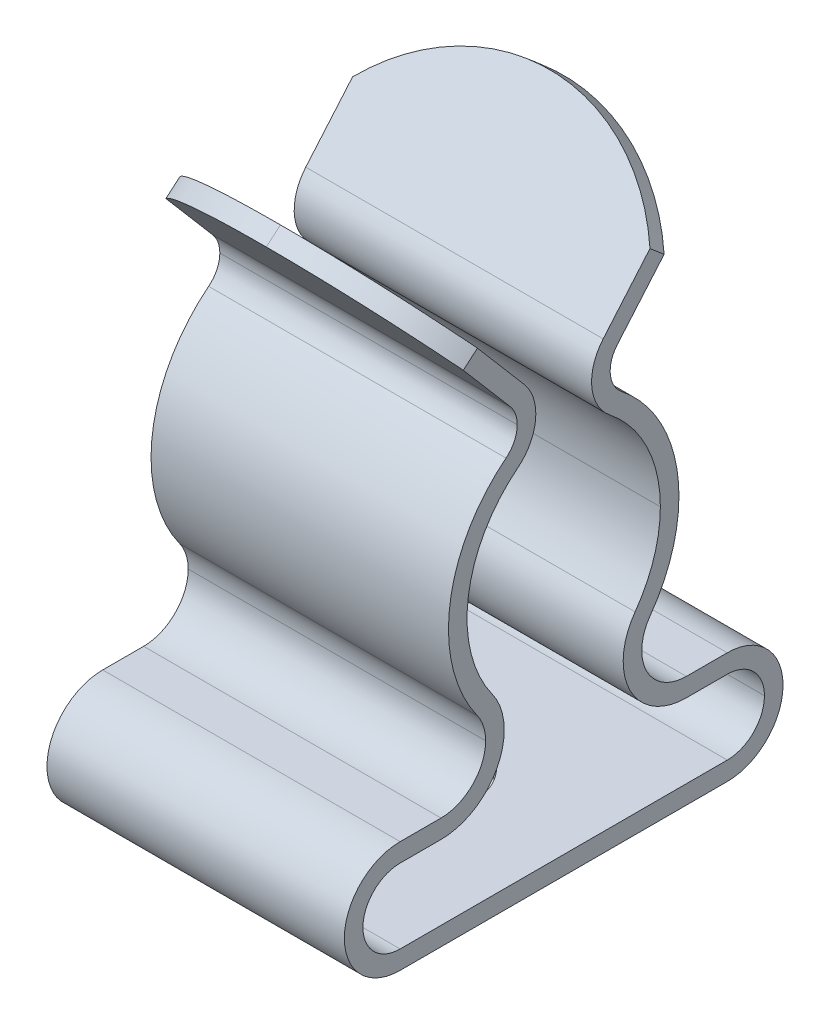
ISO-10303-21;
HEADER;
FILE_DESCRIPTION(('STEP AP214'),'2;1');
FILE_NAME('part.step','',(''),(''),'','','');
FILE_SCHEMA(('AUTOMOTIVE_DESIGN { 1 0 10303 214 1 1 1 1 }'));
ENDSEC;
DATA;
#1=APPLICATION_CONTEXT('core data for automotive mechanical design processes');
#2=APPLICATION_PROTOCOL_DEFINITION('international standard','automotive_design',2000,#1);
#3=PRODUCT_CONTEXT('',#1,'mechanical');
#4=PRODUCT('Part','Part','',(#3));
#5=PRODUCT_RELATED_PRODUCT_CATEGORY('part','',(#4));
#6=PRODUCT_DEFINITION_FORMATION('','',#4);
#7=PRODUCT_DEFINITION_CONTEXT('part definition',#1,'design');
#8=PRODUCT_DEFINITION('design','',#6,#7);
#9=PRODUCT_DEFINITION_SHAPE('','',#8);
#10=(LENGTH_UNIT() NAMED_UNIT(*) SI_UNIT(.MILLI.,.METRE.));
#11=(NAMED_UNIT(*) PLANE_ANGLE_UNIT() SI_UNIT($,.RADIAN.));
#12=(NAMED_UNIT(*) SI_UNIT($,.STERADIAN.) SOLID_ANGLE_UNIT());
#13=UNCERTAINTY_MEASURE_WITH_UNIT(LENGTH_MEASURE(1.E-05),#10,'distance_accuracy_value','');
#14=(GEOMETRIC_REPRESENTATION_CONTEXT(3) GLOBAL_UNCERTAINTY_ASSIGNED_CONTEXT((#13)) GLOBAL_UNIT_ASSIGNED_CONTEXT((#10,
#11,#12)) REPRESENTATION_CONTEXT('',''));
#15=CARTESIAN_POINT('',(0.,0.,0.));
#16=DIRECTION('',(0.,0.,1.));
#17=DIRECTION('',(1.,0.,0.));
#18=AXIS2_PLACEMENT_3D('',#15,#16,#17);
#19=CARTESIAN_POINT('',(20.,5.45,0.));
#20=DIRECTION('',(0.,-1.,0.));
#21=DIRECTION('',(1.,0.,0.));
#22=AXIS2_PLACEMENT_3D('',#19,#20,#21);
#23=CYLINDRICAL_SURFACE('',#22,1.55);
#24=DIRECTION('',(0.,-1.,0.));
#25=VECTOR('',#24,1.);
#26=CARTESIAN_POINT('',(18.45,5.45,0.));
#27=LINE('',#26,#25);
#28=CARTESIAN_POINT('',(18.45,5.95,0.));
#29=VERTEX_POINT('',#28);
#30=CARTESIAN_POINT('',(18.45,5.45,0.));
#31=VERTEX_POINT('',#30);
#32=EDGE_CURVE('E768',#29,#31,#27,.T.);
#33=ORIENTED_EDGE('',*,*,#32,.F.);
#34=CARTESIAN_POINT('',(20.,5.95,0.));
#35=DIRECTION('',(0.,1.,0.));
#36=DIRECTION('',(-1.,0.,0.));
#37=AXIS2_PLACEMENT_3D('',#34,#35,#36);
#38=CIRCLE('',#37,1.55);
#39=CARTESIAN_POINT('',(21.55,5.95,0.));
#40=VERTEX_POINT('',#39);
#41=EDGE_CURVE('E510',#29,#40,#38,.T.);
#42=ORIENTED_EDGE('',*,*,#41,.T.);
#43=DIRECTION('',(0.,-1.,0.));
#44=VECTOR('',#43,1.);
#45=CARTESIAN_POINT('',(21.55,5.45,0.));
#46=LINE('',#45,#44);
#47=CARTESIAN_POINT('',(21.55,5.45,0.));
#48=VERTEX_POINT('',#47);
#49=EDGE_CURVE('E757',#40,#48,#46,.T.);
#50=ORIENTED_EDGE('',*,*,#49,.T.);
#51=CARTESIAN_POINT('',(20.,5.45,0.));
#52=DIRECTION('',(0.,-1.,0.));
#53=DIRECTION('',(1.,0.,0.));
#54=AXIS2_PLACEMENT_3D('',#51,#52,#53);
#55=CIRCLE('',#54,1.55);
#56=EDGE_CURVE('E307',#48,#31,#55,.T.);
#57=ORIENTED_EDGE('',*,*,#56,.T.);
#58=EDGE_LOOP('',(#33,#42,#50,#57));
#59=FACE_BOUND('',#58,.T.);
#60=ADVANCED_FACE('F15',(#59),#23,.F.);
#61=CARTESIAN_POINT('',(20.,21.3264094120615,5.13195390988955));
#62=DIRECTION('',(0.,-0.649448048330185,-0.76040596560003));
#63=DIRECTION('',(0.,-0.76040596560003,0.649448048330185));
#64=AXIS2_PLACEMENT_3D('',#61,#62,#63);
#65=CYLINDRICAL_SURFACE('',#64,5.);
#66=CARTESIAN_POINT('',(20.,16.6251131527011,-0.372556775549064));
#67=DIRECTION('',(0.,-0.649448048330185,-0.76040596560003));
#68=DIRECTION('',(0.,0.76040596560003,-0.649448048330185));
#69=AXIS2_PLACEMENT_3D('',#66,#67,#68);
#70=CIRCLE('',#69,5.);
#71=CARTESIAN_POINT('',(16.,18.9063310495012,-2.32090092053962));
#72=VERTEX_POINT('',#71);
#73=CARTESIAN_POINT('',(24.,18.9063310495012,-2.32090092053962));
#74=VERTEX_POINT('',#73);
#75=EDGE_CURVE('E499',#72,#74,#70,.T.);
#76=ORIENTED_EDGE('',*,*,#75,.T.);
#77=DIRECTION('',(0.,-0.649448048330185,-0.76040596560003));
#78=VECTOR('',#77,1.);
#79=CARTESIAN_POINT('',(24.,23.6076273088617,3.18360976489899));
#80=LINE('',#79,#78);
#81=CARTESIAN_POINT('',(24.,18.5816070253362,-2.70110390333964));
#82=VERTEX_POINT('',#81);
#83=EDGE_CURVE('E528',#74,#82,#80,.T.);
#84=ORIENTED_EDGE('',*,*,#83,.T.);
#85=CARTESIAN_POINT('',(20.,16.3003891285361,-0.752759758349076));
#86=DIRECTION('',(0.,0.649448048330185,0.76040596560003));
#87=DIRECTION('',(0.,-0.76040596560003,0.649448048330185));
#88=AXIS2_PLACEMENT_3D('',#85,#86,#87);
#89=CIRCLE('',#88,5.);
#90=CARTESIAN_POINT('',(16.,18.5816070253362,-2.70110390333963));
#91=VERTEX_POINT('',#90);
#92=EDGE_CURVE('E519',#82,#91,#89,.T.);
#93=ORIENTED_EDGE('',*,*,#92,.T.);
#94=DIRECTION('',(0.,-0.649448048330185,-0.76040596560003));
#95=VECTOR('',#94,1.);
#96=CARTESIAN_POINT('',(16.,23.6076273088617,3.18360976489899));
#97=LINE('',#96,#95);
#98=EDGE_CURVE('E450',#72,#91,#97,.T.);
#99=ORIENTED_EDGE('',*,*,#98,.F.);
#100=EDGE_LOOP('',(#76,#84,#93,#99));
#101=FACE_BOUND('',#100,.T.);
#102=ADVANCED_FACE('F836',(#101),#65,.T.);
#103=CARTESIAN_POINT('',(20.,21.3264094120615,-5.13195390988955));
#104=DIRECTION('',(0.,-0.649448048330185,0.76040596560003));
#105=DIRECTION('',(0.,0.76040596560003,0.649448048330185));
#106=AXIS2_PLACEMENT_3D('',#103,#104,#105);
#107=CYLINDRICAL_SURFACE('',#106,5.);
#108=DIRECTION('',(0.,-0.649448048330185,0.76040596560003));
#109=VECTOR('',#108,1.);
#110=CARTESIAN_POINT('',(20.,25.1284392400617,-1.88471366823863));
#111=LINE('',#110,#109);
#112=CARTESIAN_POINT('',(20.,20.4271429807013,3.61979701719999));
#113=VERTEX_POINT('',#112);
#114=CARTESIAN_POINT('',(20.,20.1024189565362,4.));
#115=VERTEX_POINT('',#114);
#116=EDGE_CURVE('E745',#113,#115,#111,.T.);
#117=ORIENTED_EDGE('',*,*,#116,.F.);
#118=CARTESIAN_POINT('',(20.,16.6251131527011,0.372556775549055));
#119=DIRECTION('',(0.,-0.649448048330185,0.76040596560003));
#120=DIRECTION('',(0.,-0.76040596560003,-0.649448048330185));
#121=AXIS2_PLACEMENT_3D('',#118,#119,#120);
#122=CIRCLE('',#121,5.);
#123=CARTESIAN_POINT('',(16.,18.9063310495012,2.32090092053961));
#124=VERTEX_POINT('',#123);
#125=EDGE_CURVE('E604',#113,#124,#122,.T.);
#126=ORIENTED_EDGE('',*,*,#125,.T.);
#127=DIRECTION('',(0.,-0.649448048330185,0.76040596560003));
#128=VECTOR('',#127,1.);
#129=CARTESIAN_POINT('',(16.,23.6076273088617,-3.18360976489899));
#130=LINE('',#129,#128);
#131=CARTESIAN_POINT('',(16.,18.5816070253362,2.70110390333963));
#132=VERTEX_POINT('',#131);
#133=EDGE_CURVE('E569',#124,#132,#130,.T.);
#134=ORIENTED_EDGE('',*,*,#133,.T.);
#135=CARTESIAN_POINT('',(20.,16.3003891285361,0.752759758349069));
#136=DIRECTION('',(0.,0.649448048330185,-0.76040596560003));
#137=DIRECTION('',(0.,-0.76040596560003,-0.649448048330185));
#138=AXIS2_PLACEMENT_3D('',#135,#136,#137);
#139=CIRCLE('',#138,5.);
#140=EDGE_CURVE('E592',#132,#115,#139,.T.);
#141=ORIENTED_EDGE('',*,*,#140,.T.);
#142=EDGE_LOOP('',(#117,#126,#134,#141));
#143=FACE_BOUND('',#142,.T.);
#144=ADVANCED_FACE('F841',(#143),#107,.T.);
#145=CARTESIAN_POINT('',(16.,16.5874470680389,2.05));
#146=DIRECTION('',(1.,0.,0.));
#147=DIRECTION('',(0.,0.,-1.));
#148=AXIS2_PLACEMENT_3D('',#145,#146,#147);
#149=CYLINDRICAL_SURFACE('',#148,0.8);
#150=DIRECTION('',(1.,0.,0.));
#151=VECTOR('',#150,1.);
#152=CARTESIAN_POINT('',(16.,16.5874470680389,1.25));
#153=LINE('',#152,#151);
#154=CARTESIAN_POINT('',(16.,16.5874470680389,1.25));
#155=VERTEX_POINT('',#154);
#156=CARTESIAN_POINT('',(24.,16.5874470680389,1.25));
#157=VERTEX_POINT('',#156);
#158=EDGE_CURVE('E743',#155,#157,#153,.T.);
#159=ORIENTED_EDGE('',*,*,#158,.F.);
#160=CARTESIAN_POINT('',(16.,16.5874470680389,2.05));
#161=DIRECTION('',(1.,0.,0.));
#162=DIRECTION('',(0.,0.,-1.));
#163=AXIS2_PLACEMENT_3D('',#160,#161,#162);
#164=CIRCLE('',#163,0.8);
#165=CARTESIAN_POINT('',(16.,15.9615637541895,1.55173292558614));
#166=VERTEX_POINT('',#165);
#167=EDGE_CURVE('E564',#166,#155,#164,.T.);
#168=ORIENTED_EDGE('',*,*,#167,.F.);
#169=DIRECTION('',(1.,0.,0.));
#170=VECTOR('',#169,1.);
#171=CARTESIAN_POINT('',(16.,15.9615637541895,1.55173292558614));
#172=LINE('',#171,#170);
#173=CARTESIAN_POINT('',(24.,15.9615637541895,1.55173292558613));
#174=VERTEX_POINT('',#173);
#175=EDGE_CURVE('E10',#166,#174,#172,.T.);
#176=ORIENTED_EDGE('',*,*,#175,.T.);
#177=CARTESIAN_POINT('',(24.,16.5874470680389,2.05));
#178=DIRECTION('',(1.,0.,0.));
#179=DIRECTION('',(0.,0.,-1.));
#180=AXIS2_PLACEMENT_3D('',#177,#178,#179);
#181=CIRCLE('',#180,0.8);
#182=EDGE_CURVE('E347',#174,#157,#181,.T.);
#183=ORIENTED_EDGE('',*,*,#182,.T.);
#184=EDGE_LOOP('',(#159,#168,#176,#183));
#185=FACE_BOUND('',#184,.T.);
#186=ADVANCED_FACE('F919',(#185),#149,.F.);
#187=CARTESIAN_POINT('',(16.,12.75,-1.005));
#188=DIRECTION('',(1.,0.,0.));
#189=DIRECTION('',(0.,0.,-1.));
#190=AXIS2_PLACEMENT_3D('',#187,#188,#189);
#191=CYLINDRICAL_SURFACE('',#190,4.105);
#192=CARTESIAN_POINT('',(24.,12.75,-1.005));
#193=DIRECTION('',(-1.,0.,0.));
#194=DIRECTION('',(0.,0.,1.));
#195=AXIS2_PLACEMENT_3D('',#192,#193,#194);
#196=CIRCLE('',#195,4.105);
#197=CARTESIAN_POINT('',(24.,10.3512252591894,2.32620169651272));
#198=VERTEX_POINT('',#197);
#199=EDGE_CURVE('E342',#198,#174,#196,.T.);
#200=ORIENTED_EDGE('',*,*,#199,.T.);
#201=ORIENTED_EDGE('',*,*,#175,.F.);
#202=CARTESIAN_POINT('',(16.,12.75,-1.005));
#203=DIRECTION('',(-1.,0.,0.));
#204=DIRECTION('',(0.,0.,1.));
#205=AXIS2_PLACEMENT_3D('',#202,#203,#204);
#206=CIRCLE('',#205,4.105);
#207=CARTESIAN_POINT('',(16.,10.3512252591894,2.32620169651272));
#208=VERTEX_POINT('',#207);
#209=EDGE_CURVE('E560',#208,#166,#206,.T.);
#210=ORIENTED_EDGE('',*,*,#209,.F.);
#211=DIRECTION('',(1.,0.,0.));
#212=VECTOR('',#211,1.);
#213=CARTESIAN_POINT('',(16.,10.3512252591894,2.32620169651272));
#214=LINE('',#213,#212);
#215=EDGE_CURVE('E660',#208,#198,#214,.T.);
#216=ORIENTED_EDGE('',*,*,#215,.T.);
#217=EDGE_LOOP('',(#200,#201,#210,#216));
#218=FACE_BOUND('',#217,.T.);
#219=ADVANCED_FACE('F913',(#218),#191,.T.);
#220=CARTESIAN_POINT('',(16.,9.65,3.3));
#221=DIRECTION('',(1.,0.,0.));
#222=DIRECTION('',(0.,0.,-1.));
#223=AXIS2_PLACEMENT_3D('',#220,#221,#222);
#224=CYLINDRICAL_SURFACE('',#223,1.2);
#225=DIRECTION('',(1.,0.,0.));
#226=VECTOR('',#225,1.);
#227=CARTESIAN_POINT('',(16.,9.65,2.1));
#228=LINE('',#227,#226);
#229=CARTESIAN_POINT('',(16.,9.65,2.1));
#230=VERTEX_POINT('',#229);
#231=CARTESIAN_POINT('',(24.,9.65,2.1));
#232=VERTEX_POINT('',#231);
#233=EDGE_CURVE('E658',#230,#232,#228,.T.);
#234=ORIENTED_EDGE('',*,*,#233,.F.);
#235=CARTESIAN_POINT('',(16.,9.65,3.3));
#236=DIRECTION('',(1.,0.,0.));
#237=DIRECTION('',(0.,0.,-1.));
#238=AXIS2_PLACEMENT_3D('',#235,#236,#237);
#239=CIRCLE('',#238,1.2);
#240=CARTESIAN_POINT('',(16.,8.45,3.3));
#241=VERTEX_POINT('',#240);
#242=EDGE_CURVE('E326',#241,#230,#239,.T.);
#243=ORIENTED_EDGE('',*,*,#242,.F.);
#244=DIRECTION('',(1.,0.,0.));
#245=VECTOR('',#244,1.);
#246=CARTESIAN_POINT('',(16.,8.45,3.3));
#247=LINE('',#246,#245);
#248=CARTESIAN_POINT('',(24.,8.45,3.3));
#249=VERTEX_POINT('',#248);
#250=EDGE_CURVE('E24',#241,#249,#247,.T.);
#251=ORIENTED_EDGE('',*,*,#250,.T.);
#252=CARTESIAN_POINT('',(24.,9.65,3.3));
#253=DIRECTION('',(1.,0.,0.));
#254=DIRECTION('',(0.,0.,-1.));
#255=AXIS2_PLACEMENT_3D('',#252,#253,#254);
#256=CIRCLE('',#255,1.2);
#257=EDGE_CURVE('E323',#249,#232,#256,.T.);
#258=ORIENTED_EDGE('',*,*,#257,.T.);
#259=EDGE_LOOP('',(#234,#243,#251,#258));
#260=FACE_BOUND('',#259,.T.);
#261=ADVANCED_FACE('F320',(#260),#224,.F.);
#262=CARTESIAN_POINT('',(16.,8.45,4.4));
#263=DIRECTION('',(0.,-1.,0.));
#264=DIRECTION('',(0.,0.,-1.));
#265=AXIS2_PLACEMENT_3D('',#262,#263,#264);
#266=PLANE('',#265);
#267=DIRECTION('',(0.,0.,-1.));
#268=VECTOR('',#267,1.);
#269=CARTESIAN_POINT('',(24.,8.45,4.4));
#270=LINE('',#269,#268);
#271=CARTESIAN_POINT('',(24.,8.45,4.4));
#272=VERTEX_POINT('',#271);
#273=EDGE_CURVE('E331',#272,#249,#270,.T.);
#274=ORIENTED_EDGE('',*,*,#273,.T.);
#275=ORIENTED_EDGE('',*,*,#250,.F.);
#276=DIRECTION('',(0.,0.,-1.));
#277=VECTOR('',#276,1.);
#278=CARTESIAN_POINT('',(16.,8.45,4.4));
#279=LINE('',#278,#277);
#280=CARTESIAN_POINT('',(16.,8.45,4.4));
#281=VERTEX_POINT('',#280);
#282=EDGE_CURVE('E555',#281,#241,#279,.T.);
#283=ORIENTED_EDGE('',*,*,#282,.F.);
#284=DIRECTION('',(1.,0.,0.));
#285=VECTOR('',#284,1.);
#286=CARTESIAN_POINT('',(16.,8.45,4.4));
#287=LINE('',#286,#285);
#288=EDGE_CURVE('E311',#281,#272,#287,.T.);
#289=ORIENTED_EDGE('',*,*,#288,.T.);
#290=EDGE_LOOP('',(#274,#275,#283,#289));
#291=FACE_BOUND('',#290,.T.);
#292=ADVANCED_FACE('F332',(#291),#266,.F.);
#293=CARTESIAN_POINT('',(16.,6.95,4.4));
#294=DIRECTION('',(1.,0.,0.));
#295=DIRECTION('',(0.,0.,-1.));
#296=AXIS2_PLACEMENT_3D('',#293,#294,#295);
#297=CYLINDRICAL_SURFACE('',#296,1.5);
#298=CARTESIAN_POINT('',(24.,6.95,4.4));
#299=DIRECTION('',(-1.,0.,0.));
#300=DIRECTION('',(0.,0.,1.));
#301=AXIS2_PLACEMENT_3D('',#298,#299,#300);
#302=CIRCLE('',#301,1.5);
#303=CARTESIAN_POINT('',(24.,5.45,4.4));
#304=VERTEX_POINT('',#303);
#305=EDGE_CURVE('E284',#304,#272,#302,.T.);
#306=ORIENTED_EDGE('',*,*,#305,.T.);
#307=ORIENTED_EDGE('',*,*,#288,.F.);
#308=CARTESIAN_POINT('',(16.,6.95,4.4));
#309=DIRECTION('',(-1.,0.,0.));
#310=DIRECTION('',(0.,0.,1.));
#311=AXIS2_PLACEMENT_3D('',#308,#309,#310);
#312=CIRCLE('',#311,1.5);
#313=CARTESIAN_POINT('',(16.,5.45,4.4));
#314=VERTEX_POINT('',#313);
#315=EDGE_CURVE('E551',#314,#281,#312,.T.);
#316=ORIENTED_EDGE('',*,*,#315,.F.);
#317=DIRECTION('',(1.,0.,0.));
#318=VECTOR('',#317,1.);
#319=CARTESIAN_POINT('',(16.,5.45,4.4));
#320=LINE('',#319,#318);
#321=EDGE_CURVE('E260',#314,#304,#320,.T.);
#322=ORIENTED_EDGE('',*,*,#321,.T.);
#323=EDGE_LOOP('',(#306,#307,#316,#322));
#324=FACE_BOUND('',#323,.T.);
#325=ADVANCED_FACE('F354',(#324),#297,.T.);
#326=CARTESIAN_POINT('',(16.,5.45,4.4));
#327=DIRECTION('',(0.,1.,0.));
#328=DIRECTION('',(0.,0.,1.));
#329=AXIS2_PLACEMENT_3D('',#326,#327,#328);
#330=PLANE('',#329);
#331=ORIENTED_EDGE('',*,*,#56,.F.);
#332=CARTESIAN_POINT('',(20.,5.45,0.));
#333=DIRECTION('',(0.,-1.,0.));
#334=DIRECTION('',(1.,0.,0.));
#335=AXIS2_PLACEMENT_3D('',#332,#333,#334);
#336=CIRCLE('',#335,1.55);
#337=EDGE_CURVE('E761',#31,#48,#336,.T.);
#338=ORIENTED_EDGE('',*,*,#337,.F.);
#339=EDGE_LOOP('',(#331,#338));
#340=FACE_BOUND('',#339,.T.);
#341=DIRECTION('',(0.,0.,1.));
#342=VECTOR('',#341,1.);
#343=CARTESIAN_POINT('',(24.,5.45,4.4));
#344=LINE('',#343,#342);
#345=CARTESIAN_POINT('',(24.,5.45,-4.4));
#346=VERTEX_POINT('',#345);
#347=EDGE_CURVE('E277',#346,#304,#344,.T.);
#348=ORIENTED_EDGE('',*,*,#347,.T.);
#349=ORIENTED_EDGE('',*,*,#321,.F.);
#350=DIRECTION('',(0.,0.,1.));
#351=VECTOR('',#350,1.);
#352=CARTESIAN_POINT('',(16.,5.45,4.4));
#353=LINE('',#352,#351);
#354=CARTESIAN_POINT('',(16.,5.45,-4.4));
#355=VERTEX_POINT('',#354);
#356=EDGE_CURVE('E363',#355,#314,#353,.T.);
#357=ORIENTED_EDGE('',*,*,#356,.F.);
#358=DIRECTION('',(1.,0.,0.));
#359=VECTOR('',#358,1.);
#360=CARTESIAN_POINT('',(16.,5.45,-4.4));
#361=LINE('',#360,#359);
#362=EDGE_CURVE('E360',#355,#346,#361,.T.);
#363=ORIENTED_EDGE('',*,*,#362,.T.);
#364=EDGE_LOOP('',(#348,#349,#357,#363));
#365=FACE_BOUND('',#364,.T.);
#366=ADVANCED_FACE('F361',(#340,#365),#330,.F.);
#367=CARTESIAN_POINT('',(16.,6.95,-4.4));
#368=DIRECTION('',(1.,0.,0.));
#369=DIRECTION('',(0.,0.,-1.));
#370=AXIS2_PLACEMENT_3D('',#367,#368,#369);
#371=CYLINDRICAL_SURFACE('',#370,1.5);
#372=DIRECTION('',(1.,0.,0.));
#373=VECTOR('',#372,1.);
#374=CARTESIAN_POINT('',(16.,6.95,-5.9));
#375=LINE('',#374,#373);
#376=CARTESIAN_POINT('',(16.,6.95,-5.9));
#377=VERTEX_POINT('',#376);
#378=CARTESIAN_POINT('',(24.,6.95,-5.9));
#379=VERTEX_POINT('',#378);
#380=EDGE_CURVE('E371',#377,#379,#375,.T.);
#381=ORIENTED_EDGE('',*,*,#380,.F.);
#382=CARTESIAN_POINT('',(16.,6.95,-4.4));
#383=DIRECTION('',(-1.,0.,0.));
#384=DIRECTION('',(0.,0.,-1.));
#385=AXIS2_PLACEMENT_3D('',#382,#383,#384);
#386=CIRCLE('',#385,1.5);
#387=CARTESIAN_POINT('',(16.,8.45,-4.4));
#388=VERTEX_POINT('',#387);
#389=EDGE_CURVE('E255',#388,#377,#386,.T.);
#390=ORIENTED_EDGE('',*,*,#389,.F.);
#391=DIRECTION('',(1.,0.,0.));
#392=VECTOR('',#391,1.);
#393=CARTESIAN_POINT('',(16.,8.45,-4.4));
#394=LINE('',#393,#392);
#395=CARTESIAN_POINT('',(24.,8.45,-4.4));
#396=VERTEX_POINT('',#395);
#397=EDGE_CURVE('E247',#388,#396,#394,.T.);
#398=ORIENTED_EDGE('',*,*,#397,.T.);
#399=CARTESIAN_POINT('',(24.,6.95,-4.4));
#400=DIRECTION('',(-1.,0.,0.));
#401=DIRECTION('',(0.,0.,-1.));
#402=AXIS2_PLACEMENT_3D('',#399,#400,#401);
#403=CIRCLE('',#402,1.5);
#404=EDGE_CURVE('E252',#396,#379,#403,.T.);
#405=ORIENTED_EDGE('',*,*,#404,.T.);
#406=EDGE_LOOP('',(#381,#390,#398,#405));
#407=FACE_BOUND('',#406,.T.);
#408=ADVANCED_FACE('F250',(#407),#371,.T.);
#409=CARTESIAN_POINT('',(16.,8.45,-4.4));
#410=DIRECTION('',(0.,-1.,0.));
#411=DIRECTION('',(1.,0.,0.));
#412=AXIS2_PLACEMENT_3D('',#409,#410,#411);
#413=PLANE('',#412);
#414=DIRECTION('',(0.,0.,-1.));
#415=VECTOR('',#414,1.);
#416=CARTESIAN_POINT('',(24.,8.45,-4.4));
#417=LINE('',#416,#415);
#418=CARTESIAN_POINT('',(24.,8.45,-3.3));
#419=VERTEX_POINT('',#418);
#420=EDGE_CURVE('E264',#419,#396,#417,.T.);
#421=ORIENTED_EDGE('',*,*,#420,.T.);
#422=ORIENTED_EDGE('',*,*,#397,.F.);
#423=DIRECTION('',(0.,0.,-1.));
#424=VECTOR('',#423,1.);
#425=CARTESIAN_POINT('',(16.,8.45,-4.4));
#426=LINE('',#425,#424);
#427=CARTESIAN_POINT('',(16.,8.45,-3.3));
#428=VERTEX_POINT('',#427);
#429=EDGE_CURVE('E544',#428,#388,#426,.T.);
#430=ORIENTED_EDGE('',*,*,#429,.F.);
#431=DIRECTION('',(1.,0.,0.));
#432=VECTOR('',#431,1.);
#433=CARTESIAN_POINT('',(16.,8.45,-3.3));
#434=LINE('',#433,#432);
#435=EDGE_CURVE('E261',#428,#419,#434,.T.);
#436=ORIENTED_EDGE('',*,*,#435,.T.);
#437=EDGE_LOOP('',(#421,#422,#430,#436));
#438=FACE_BOUND('',#437,.T.);
#439=ADVANCED_FACE('F265',(#438),#413,.F.);
#440=CARTESIAN_POINT('',(16.,9.65,-3.3));
#441=DIRECTION('',(1.,0.,0.));
#442=DIRECTION('',(0.,0.,-1.));
#443=AXIS2_PLACEMENT_3D('',#440,#441,#442);
#444=CYLINDRICAL_SURFACE('',#443,1.2);
#445=CARTESIAN_POINT('',(24.,9.65,-3.3));
#446=DIRECTION('',(1.,0.,0.));
#447=DIRECTION('',(0.,0.,1.));
#448=AXIS2_PLACEMENT_3D('',#445,#446,#447);
#449=CIRCLE('',#448,1.2);
#450=CARTESIAN_POINT('',(24.,10.3512252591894,-2.32620169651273));
#451=VERTEX_POINT('',#450);
#452=EDGE_CURVE('E269',#451,#419,#449,.T.);
#453=ORIENTED_EDGE('',*,*,#452,.T.);
#454=ORIENTED_EDGE('',*,*,#435,.F.);
#455=CARTESIAN_POINT('',(16.,9.65,-3.3));
#456=DIRECTION('',(1.,0.,0.));
#457=DIRECTION('',(0.,0.,1.));
#458=AXIS2_PLACEMENT_3D('',#455,#456,#457);
#459=CIRCLE('',#458,1.2);
#460=CARTESIAN_POINT('',(16.,10.3512252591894,-2.32620169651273));
#461=VERTEX_POINT('',#460);
#462=EDGE_CURVE('E382',#461,#428,#459,.T.);
#463=ORIENTED_EDGE('',*,*,#462,.F.);
#464=DIRECTION('',(1.,0.,0.));
#465=VECTOR('',#464,1.);
#466=CARTESIAN_POINT('',(16.,10.3512252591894,-2.32620169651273));
#467=LINE('',#466,#465);
#468=EDGE_CURVE('E406',#461,#451,#467,.T.);
#469=ORIENTED_EDGE('',*,*,#468,.T.);
#470=EDGE_LOOP('',(#453,#454,#463,#469));
#471=FACE_BOUND('',#470,.T.);
#472=ADVANCED_FACE('F951',(#471),#444,.F.);
#473=CARTESIAN_POINT('',(16.,12.75,1.005));
#474=DIRECTION('',(1.,0.,0.));
#475=DIRECTION('',(0.,0.,-1.));
#476=AXIS2_PLACEMENT_3D('',#473,#474,#475);
#477=CYLINDRICAL_SURFACE('',#476,4.105);
#478=DIRECTION('',(1.,0.,0.));
#479=VECTOR('',#478,1.);
#480=CARTESIAN_POINT('',(16.,12.75,-3.1));
#481=LINE('',#480,#479);
#482=CARTESIAN_POINT('',(16.,12.75,-3.1));
#483=VERTEX_POINT('',#482);
#484=CARTESIAN_POINT('',(24.,12.75,-3.1));
#485=VERTEX_POINT('',#484);
#486=EDGE_CURVE('E387',#483,#485,#481,.T.);
#487=ORIENTED_EDGE('',*,*,#486,.F.);
#488=CARTESIAN_POINT('',(16.,12.75,1.005));
#489=DIRECTION('',(-1.,0.,0.));
#490=DIRECTION('',(0.,0.,-1.));
#491=AXIS2_PLACEMENT_3D('',#488,#489,#490);
#492=CIRCLE('',#491,4.105);
#493=CARTESIAN_POINT('',(16.,15.9615637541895,-1.55173292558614));
#494=VERTEX_POINT('',#493);
#495=EDGE_CURVE('E379',#494,#483,#492,.T.);
#496=ORIENTED_EDGE('',*,*,#495,.F.);
#497=DIRECTION('',(1.,0.,0.));
#498=VECTOR('',#497,1.);
#499=CARTESIAN_POINT('',(16.,15.9615637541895,-1.55173292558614));
#500=LINE('',#499,#498);
#501=CARTESIAN_POINT('',(24.,15.9615637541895,-1.55173292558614));
#502=VERTEX_POINT('',#501);
#503=EDGE_CURVE('E36',#494,#502,#500,.T.);
#504=ORIENTED_EDGE('',*,*,#503,.T.);
#505=CARTESIAN_POINT('',(24.,12.75,1.005));
#506=DIRECTION('',(-1.,0.,0.));
#507=DIRECTION('',(0.,0.,-1.));
#508=AXIS2_PLACEMENT_3D('',#505,#506,#507);
#509=CIRCLE('',#508,4.105);
#510=EDGE_CURVE('E289',#502,#485,#509,.T.);
#511=ORIENTED_EDGE('',*,*,#510,.T.);
#512=EDGE_LOOP('',(#487,#496,#504,#511));
#513=FACE_BOUND('',#512,.T.);
#514=ADVANCED_FACE('F954',(#513),#477,.T.);
#515=CARTESIAN_POINT('',(16.,16.5874470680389,-2.05));
#516=DIRECTION('',(1.,0.,0.));
#517=DIRECTION('',(0.,0.,-1.));
#518=AXIS2_PLACEMENT_3D('',#515,#516,#517);
#519=CYLINDRICAL_SURFACE('',#518,0.8);
#520=CARTESIAN_POINT('',(24.,16.5874470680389,-2.05));
#521=DIRECTION('',(1.,0.,0.));
#522=DIRECTION('',(0.,0.,1.));
#523=AXIS2_PLACEMENT_3D('',#520,#521,#522);
#524=CIRCLE('',#523,0.8);
#525=CARTESIAN_POINT('',(24.,17.107005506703,-1.44167522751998));
#526=VERTEX_POINT('',#525);
#527=EDGE_CURVE('E292',#526,#502,#524,.T.);
#528=ORIENTED_EDGE('',*,*,#527,.T.);
#529=ORIENTED_EDGE('',*,*,#503,.F.);
#530=CARTESIAN_POINT('',(16.,16.5874470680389,-2.05));
#531=DIRECTION('',(1.,0.,0.));
#532=DIRECTION('',(0.,0.,1.));
#533=AXIS2_PLACEMENT_3D('',#530,#531,#532);
#534=CIRCLE('',#533,0.8);
#535=CARTESIAN_POINT('',(16.,17.107005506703,-1.44167522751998));
#536=VERTEX_POINT('',#535);
#537=EDGE_CURVE('E383',#536,#494,#534,.T.);
#538=ORIENTED_EDGE('',*,*,#537,.F.);
#539=DIRECTION('',(1.,0.,0.));
#540=VECTOR('',#539,1.);
#541=CARTESIAN_POINT('',(16.,17.107005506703,-1.44167522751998));
#542=LINE('',#541,#540);
#543=EDGE_CURVE('E532',#536,#526,#542,.T.);
#544=ORIENTED_EDGE('',*,*,#543,.T.);
#545=EDGE_LOOP('',(#528,#529,#538,#544));
#546=FACE_BOUND('',#545,.T.);
#547=ADVANCED_FACE('F958',(#546),#519,.F.);
#548=CARTESIAN_POINT('',(16.,16.5874470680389,-2.05));
#549=DIRECTION('',(1.,0.,0.));
#550=DIRECTION('',(0.,0.,-1.));
#551=AXIS2_PLACEMENT_3D('',#548,#549,#550);
#552=CYLINDRICAL_SURFACE('',#551,1.3);
#553=CARTESIAN_POINT('',(24.,16.5874470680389,-2.05));
#554=DIRECTION('',(1.,0.,0.));
#555=DIRECTION('',(0.,0.,1.));
#556=AXIS2_PLACEMENT_3D('',#553,#554,#555);
#557=CIRCLE('',#556,1.3);
#558=CARTESIAN_POINT('',(24.,17.4317295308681,-1.06147224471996));
#559=VERTEX_POINT('',#558);
#560=CARTESIAN_POINT('',(24.,15.5703866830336,-1.24031600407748));
#561=VERTEX_POINT('',#560);
#562=EDGE_CURVE('E524',#559,#561,#557,.T.);
#563=ORIENTED_EDGE('',*,*,#562,.F.);
#564=DIRECTION('',(1.,0.,0.));
#565=VECTOR('',#564,1.);
#566=CARTESIAN_POINT('',(16.,17.4317295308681,-1.06147224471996));
#567=LINE('',#566,#565);
#568=CARTESIAN_POINT('',(16.,17.4317295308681,-1.06147224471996));
#569=VERTEX_POINT('',#568);
#570=EDGE_CURVE('E507',#569,#559,#567,.T.);
#571=ORIENTED_EDGE('',*,*,#570,.F.);
#572=CARTESIAN_POINT('',(16.,16.5874470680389,-2.05));
#573=DIRECTION('',(1.,0.,0.));
#574=DIRECTION('',(0.,0.,1.));
#575=AXIS2_PLACEMENT_3D('',#572,#573,#574);
#576=CIRCLE('',#575,1.3);
#577=CARTESIAN_POINT('',(16.,15.5703866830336,-1.24031600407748));
#578=VERTEX_POINT('',#577);
#579=EDGE_CURVE('E428',#569,#578,#576,.T.);
#580=ORIENTED_EDGE('',*,*,#579,.T.);
#581=DIRECTION('',(1.,0.,0.));
#582=VECTOR('',#581,1.);
#583=CARTESIAN_POINT('',(16.,15.5703866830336,-1.24031600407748));
#584=LINE('',#583,#582);
#585=EDGE_CURVE('E440',#578,#561,#584,.T.);
#586=ORIENTED_EDGE('',*,*,#585,.T.);
#587=EDGE_LOOP('',(#563,#571,#580,#586));
#588=FACE_BOUND('',#587,.T.);
#589=ADVANCED_FACE('F790',(#588),#552,.T.);
#590=CARTESIAN_POINT('',(16.,12.75,1.005));
#591=DIRECTION('',(1.,0.,0.));
#592=DIRECTION('',(0.,0.,-1.));
#593=AXIS2_PLACEMENT_3D('',#590,#591,#592);
#594=CYLINDRICAL_SURFACE('',#593,3.605);
#595=DIRECTION('',(1.,0.,0.));
#596=VECTOR('',#595,1.);
#597=CARTESIAN_POINT('',(16.,12.75,-2.6));
#598=LINE('',#597,#596);
#599=CARTESIAN_POINT('',(16.,12.75,-2.6));
#600=VERTEX_POINT('',#599);
#601=CARTESIAN_POINT('',(24.,12.75,-2.6));
#602=VERTEX_POINT('',#601);
#603=EDGE_CURVE('E423',#600,#602,#598,.T.);
#604=ORIENTED_EDGE('',*,*,#603,.F.);
#605=CARTESIAN_POINT('',(16.,12.75,1.005));
#606=DIRECTION('',(-1.,0.,0.));
#607=DIRECTION('',(0.,0.,1.));
#608=AXIS2_PLACEMENT_3D('',#605,#606,#607);
#609=CIRCLE('',#608,3.605);
#610=CARTESIAN_POINT('',(16.,10.6434024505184,-1.92045240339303));
#611=VERTEX_POINT('',#610);
#612=EDGE_CURVE('E424',#600,#611,#609,.T.);
#613=ORIENTED_EDGE('',*,*,#612,.T.);
#614=DIRECTION('',(1.,0.,0.));
#615=VECTOR('',#614,1.);
#616=CARTESIAN_POINT('',(16.,10.6434024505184,-1.92045240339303));
#617=LINE('',#616,#615);
#618=CARTESIAN_POINT('',(24.,10.6434024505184,-1.92045240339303));
#619=VERTEX_POINT('',#618);
#620=EDGE_CURVE('E306',#611,#619,#617,.T.);
#621=ORIENTED_EDGE('',*,*,#620,.T.);
#622=CARTESIAN_POINT('',(24.,12.75,1.005));
#623=DIRECTION('',(-1.,0.,0.));
#624=DIRECTION('',(0.,0.,1.));
#625=AXIS2_PLACEMENT_3D('',#622,#623,#624);
#626=CIRCLE('',#625,3.605);
#627=EDGE_CURVE('E527',#602,#619,#626,.T.);
#628=ORIENTED_EDGE('',*,*,#627,.F.);
#629=EDGE_LOOP('',(#604,#613,#621,#628));
#630=FACE_BOUND('',#629,.T.);
#631=ADVANCED_FACE('F799',(#630),#594,.F.);
#632=CARTESIAN_POINT('',(16.,9.65,-3.3));
#633=DIRECTION('',(1.,0.,0.));
#634=DIRECTION('',(0.,0.,-1.));
#635=AXIS2_PLACEMENT_3D('',#632,#633,#634);
#636=CYLINDRICAL_SURFACE('',#635,1.7);
#637=CARTESIAN_POINT('',(24.,9.65,-3.3));
#638=DIRECTION('',(1.,0.,0.));
#639=DIRECTION('',(0.,0.,1.));
#640=AXIS2_PLACEMENT_3D('',#637,#638,#639);
#641=CIRCLE('',#640,1.7);
#642=CARTESIAN_POINT('',(24.,7.95,-3.3));
#643=VERTEX_POINT('',#642);
#644=EDGE_CURVE('E392',#619,#643,#641,.T.);
#645=ORIENTED_EDGE('',*,*,#644,.F.);
#646=ORIENTED_EDGE('',*,*,#620,.F.);
#647=CARTESIAN_POINT('',(16.,9.65,-3.3));
#648=DIRECTION('',(1.,0.,0.));
#649=DIRECTION('',(0.,0.,1.));
#650=AXIS2_PLACEMENT_3D('',#647,#648,#649);
#651=CIRCLE('',#650,1.7);
#652=CARTESIAN_POINT('',(16.,7.95,-3.3));
#653=VERTEX_POINT('',#652);
#654=EDGE_CURVE('E429',#611,#653,#651,.T.);
#655=ORIENTED_EDGE('',*,*,#654,.T.);
#656=DIRECTION('',(1.,0.,0.));
#657=VECTOR('',#656,1.);
#658=CARTESIAN_POINT('',(16.,7.95,-3.3));
#659=LINE('',#658,#657);
#660=EDGE_CURVE('E436',#653,#643,#659,.T.);
#661=ORIENTED_EDGE('',*,*,#660,.T.);
#662=EDGE_LOOP('',(#645,#646,#655,#661));
#663=FACE_BOUND('',#662,.T.);
#664=ADVANCED_FACE('F803',(#663),#636,.T.);
#665=CARTESIAN_POINT('',(16.,7.95,-4.4));
#666=DIRECTION('',(0.,-1.,0.));
#667=DIRECTION('',(1.,0.,0.));
#668=AXIS2_PLACEMENT_3D('',#665,#666,#667);
#669=PLANE('',#668);
#670=DIRECTION('',(0.,0.,-1.));
#671=VECTOR('',#670,1.);
#672=CARTESIAN_POINT('',(24.,7.95,-4.4));
#673=LINE('',#672,#671);
#674=CARTESIAN_POINT('',(24.,7.95,-4.4));
#675=VERTEX_POINT('',#674);
#676=EDGE_CURVE('E388',#643,#675,#673,.T.);
#677=ORIENTED_EDGE('',*,*,#676,.F.);
#678=ORIENTED_EDGE('',*,*,#660,.F.);
#679=DIRECTION('',(0.,0.,-1.));
#680=VECTOR('',#679,1.);
#681=CARTESIAN_POINT('',(16.,7.95,-4.4));
#682=LINE('',#681,#680);
#683=CARTESIAN_POINT('',(16.,7.95,-4.4));
#684=VERTEX_POINT('',#683);
#685=EDGE_CURVE('E418',#653,#684,#682,.T.);
#686=ORIENTED_EDGE('',*,*,#685,.T.);
#687=DIRECTION('',(1.,0.,0.));
#688=VECTOR('',#687,1.);
#689=CARTESIAN_POINT('',(16.,7.95,-4.4));
#690=LINE('',#689,#688);
#691=EDGE_CURVE('E462',#684,#675,#690,.T.);
#692=ORIENTED_EDGE('',*,*,#691,.T.);
#693=EDGE_LOOP('',(#677,#678,#686,#692));
#694=FACE_BOUND('',#693,.T.);
#695=ADVANCED_FACE('F808',(#694),#669,.T.);
#696=CARTESIAN_POINT('',(16.,6.95,-4.4));
#697=DIRECTION('',(1.,0.,0.));
#698=DIRECTION('',(0.,0.,-1.));
#699=AXIS2_PLACEMENT_3D('',#696,#697,#698);
#700=CYLINDRICAL_SURFACE('',#699,1.);
#701=DIRECTION('',(1.,0.,0.));
#702=VECTOR('',#701,1.);
#703=CARTESIAN_POINT('',(16.,6.95,-5.4));
#704=LINE('',#703,#702);
#705=CARTESIAN_POINT('',(16.,6.95,-5.4));
#706=VERTEX_POINT('',#705);
#707=CARTESIAN_POINT('',(24.,6.95,-5.4));
#708=VERTEX_POINT('',#707);
#709=EDGE_CURVE('E454',#706,#708,#704,.T.);
#710=ORIENTED_EDGE('',*,*,#709,.F.);
#711=CARTESIAN_POINT('',(16.,6.95,-4.4));
#712=DIRECTION('',(-1.,0.,0.));
#713=DIRECTION('',(0.,0.,1.));
#714=AXIS2_PLACEMENT_3D('',#711,#712,#713);
#715=CIRCLE('',#714,1.);
#716=CARTESIAN_POINT('',(16.,5.95,-4.4));
#717=VERTEX_POINT('',#716);
#718=EDGE_CURVE('E414',#706,#717,#715,.T.);
#719=ORIENTED_EDGE('',*,*,#718,.T.);
#720=DIRECTION('',(1.,0.,0.));
#721=VECTOR('',#720,1.);
#722=CARTESIAN_POINT('',(16.,5.95,-4.4));
#723=LINE('',#722,#721);
#724=CARTESIAN_POINT('',(24.,5.95,-4.4));
#725=VERTEX_POINT('',#724);
#726=EDGE_CURVE('E303',#717,#725,#723,.T.);
#727=ORIENTED_EDGE('',*,*,#726,.T.);
#728=CARTESIAN_POINT('',(24.,6.95,-4.4));
#729=DIRECTION('',(-1.,0.,0.));
#730=DIRECTION('',(0.,0.,1.));
#731=AXIS2_PLACEMENT_3D('',#728,#729,#730);
#732=CIRCLE('',#731,1.);
#733=EDGE_CURVE('E391',#708,#725,#732,.T.);
#734=ORIENTED_EDGE('',*,*,#733,.F.);
#735=EDGE_LOOP('',(#710,#719,#727,#734));
#736=FACE_BOUND('',#735,.T.);
#737=ADVANCED_FACE('F816',(#736),#700,.F.);
#738=CARTESIAN_POINT('',(16.,5.95,4.4));
#739=DIRECTION('',(0.,1.,0.));
#740=DIRECTION('',(0.,0.,1.));
#741=AXIS2_PLACEMENT_3D('',#738,#739,#740);
#742=PLANE('',#741);
#743=CARTESIAN_POINT('',(20.,5.95,0.));
#744=DIRECTION('',(0.,1.,0.));
#745=DIRECTION('',(-1.,0.,0.));
#746=AXIS2_PLACEMENT_3D('',#743,#744,#745);
#747=CIRCLE('',#746,1.55);
#748=EDGE_CURVE('E775',#40,#29,#747,.T.);
#749=ORIENTED_EDGE('',*,*,#748,.F.);
#750=ORIENTED_EDGE('',*,*,#41,.F.);
#751=EDGE_LOOP('',(#749,#750));
#752=FACE_BOUND('',#751,.T.);
#753=DIRECTION('',(0.,0.,1.));
#754=VECTOR('',#753,1.);
#755=CARTESIAN_POINT('',(24.,5.95,4.4));
#756=LINE('',#755,#754);
#757=CARTESIAN_POINT('',(24.,5.95,4.4));
#758=VERTEX_POINT('',#757);
#759=EDGE_CURVE('E616',#725,#758,#756,.T.);
#760=ORIENTED_EDGE('',*,*,#759,.F.);
#761=ORIENTED_EDGE('',*,*,#726,.F.);
#762=DIRECTION('',(0.,0.,1.));
#763=VECTOR('',#762,1.);
#764=CARTESIAN_POINT('',(16.,5.95,4.4));
#765=LINE('',#764,#763);
#766=CARTESIAN_POINT('',(16.,5.95,4.4));
#767=VERTEX_POINT('',#766);
#768=EDGE_CURVE('E419',#717,#767,#765,.T.);
#769=ORIENTED_EDGE('',*,*,#768,.T.);
#770=DIRECTION('',(1.,0.,0.));
#771=VECTOR('',#770,1.);
#772=CARTESIAN_POINT('',(16.,5.95,4.4));
#773=LINE('',#772,#771);
#774=EDGE_CURVE('E300',#767,#758,#773,.T.);
#775=ORIENTED_EDGE('',*,*,#774,.T.);
#776=EDGE_LOOP('',(#760,#761,#769,#775));
#777=FACE_BOUND('',#776,.T.);
#778=ADVANCED_FACE('F820',(#752,#777),#742,.T.);
#779=CARTESIAN_POINT('',(16.,6.95,4.4));
#780=DIRECTION('',(1.,0.,0.));
#781=DIRECTION('',(0.,0.,-1.));
#782=AXIS2_PLACEMENT_3D('',#779,#780,#781);
#783=CYLINDRICAL_SURFACE('',#782,1.);
#784=CARTESIAN_POINT('',(24.,6.95,4.4));
#785=DIRECTION('',(-1.,0.,0.));
#786=DIRECTION('',(0.,0.,1.));
#787=AXIS2_PLACEMENT_3D('',#784,#785,#786);
#788=CIRCLE('',#787,1.);
#789=CARTESIAN_POINT('',(24.,7.95,4.4));
#790=VERTEX_POINT('',#789);
#791=EDGE_CURVE('E620',#758,#790,#788,.T.);
#792=ORIENTED_EDGE('',*,*,#791,.F.);
#793=ORIENTED_EDGE('',*,*,#774,.F.);
#794=CARTESIAN_POINT('',(16.,6.95,4.4));
#795=DIRECTION('',(-1.,0.,0.));
#796=DIRECTION('',(0.,0.,1.));
#797=AXIS2_PLACEMENT_3D('',#794,#795,#796);
#798=CIRCLE('',#797,1.);
#799=CARTESIAN_POINT('',(16.,7.95,4.4));
#800=VERTEX_POINT('',#799);
#801=EDGE_CURVE('E475',#767,#800,#798,.T.);
#802=ORIENTED_EDGE('',*,*,#801,.T.);
#803=DIRECTION('',(1.,0.,0.));
#804=VECTOR('',#803,1.);
#805=CARTESIAN_POINT('',(16.,7.95,4.4));
#806=LINE('',#805,#804);
#807=EDGE_CURVE('E299',#800,#790,#806,.T.);
#808=ORIENTED_EDGE('',*,*,#807,.T.);
#809=EDGE_LOOP('',(#792,#793,#802,#808));
#810=FACE_BOUND('',#809,.T.);
#811=ADVANCED_FACE('F823',(#810),#783,.F.);
#812=CARTESIAN_POINT('',(16.,7.95,4.4));
#813=DIRECTION('',(0.,-1.,0.));
#814=DIRECTION('',(0.,0.,-1.));
#815=AXIS2_PLACEMENT_3D('',#812,#813,#814);
#816=PLANE('',#815);
#817=DIRECTION('',(0.,0.,-1.));
#818=VECTOR('',#817,1.);
#819=CARTESIAN_POINT('',(24.,7.95,4.4));
#820=LINE('',#819,#818);
#821=CARTESIAN_POINT('',(24.,7.95,3.3));
#822=VERTEX_POINT('',#821);
#823=EDGE_CURVE('E624',#790,#822,#820,.T.);
#824=ORIENTED_EDGE('',*,*,#823,.F.);
#825=ORIENTED_EDGE('',*,*,#807,.F.);
#826=DIRECTION('',(0.,0.,-1.));
#827=VECTOR('',#826,1.);
#828=CARTESIAN_POINT('',(16.,7.95,4.4));
#829=LINE('',#828,#827);
#830=CARTESIAN_POINT('',(16.,7.95,3.3));
#831=VERTEX_POINT('',#830);
#832=EDGE_CURVE('E401',#800,#831,#829,.T.);
#833=ORIENTED_EDGE('',*,*,#832,.T.);
#834=DIRECTION('',(1.,0.,0.));
#835=VECTOR('',#834,1.);
#836=CARTESIAN_POINT('',(16.,7.95,3.3));
#837=LINE('',#836,#835);
#838=EDGE_CURVE('E479',#831,#822,#837,.T.);
#839=ORIENTED_EDGE('',*,*,#838,.T.);
#840=EDGE_LOOP('',(#824,#825,#833,#839));
#841=FACE_BOUND('',#840,.T.);
#842=ADVANCED_FACE('F825',(#841),#816,.T.);
#843=CARTESIAN_POINT('',(16.,9.65,3.3));
#844=DIRECTION('',(1.,0.,0.));
#845=DIRECTION('',(0.,0.,-1.));
#846=AXIS2_PLACEMENT_3D('',#843,#844,#845);
#847=CYLINDRICAL_SURFACE('',#846,1.7);
#848=DIRECTION('',(1.,0.,0.));
#849=VECTOR('',#848,1.);
#850=CARTESIAN_POINT('',(16.,9.65,1.6));
#851=LINE('',#850,#849);
#852=CARTESIAN_POINT('',(16.,9.65,1.6));
#853=VERTEX_POINT('',#852);
#854=CARTESIAN_POINT('',(24.,9.65,1.6));
#855=VERTEX_POINT('',#854);
#856=EDGE_CURVE('E470',#853,#855,#851,.T.);
#857=ORIENTED_EDGE('',*,*,#856,.F.);
#858=CARTESIAN_POINT('',(16.,9.65,3.3));
#859=DIRECTION('',(1.,0.,0.));
#860=DIRECTION('',(0.,0.,1.));
#861=AXIS2_PLACEMENT_3D('',#858,#859,#860);
#862=CIRCLE('',#861,1.7);
#863=CARTESIAN_POINT('',(16.,10.6434024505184,1.92045240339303));
#864=VERTEX_POINT('',#863);
#865=EDGE_CURVE('E397',#853,#864,#862,.T.);
#866=ORIENTED_EDGE('',*,*,#865,.T.);
#867=DIRECTION('',(1.,0.,0.));
#868=VECTOR('',#867,1.);
#869=CARTESIAN_POINT('',(16.,10.6434024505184,1.92045240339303));
#870=LINE('',#869,#868);
#871=CARTESIAN_POINT('',(24.,10.6434024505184,1.92045240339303));
#872=VERTEX_POINT('',#871);
#873=EDGE_CURVE('E295',#864,#872,#870,.T.);
#874=ORIENTED_EDGE('',*,*,#873,.T.);
#875=CARTESIAN_POINT('',(24.,9.65,3.3));
#876=DIRECTION('',(1.,0.,0.));
#877=DIRECTION('',(0.,0.,1.));
#878=AXIS2_PLACEMENT_3D('',#875,#876,#877);
#879=CIRCLE('',#878,1.7);
#880=EDGE_CURVE('E627',#855,#872,#879,.T.);
#881=ORIENTED_EDGE('',*,*,#880,.F.);
#882=EDGE_LOOP('',(#857,#866,#874,#881));
#883=FACE_BOUND('',#882,.T.);
#884=ADVANCED_FACE('F688',(#883),#847,.T.);
#885=CARTESIAN_POINT('',(16.,12.75,-1.005));
#886=DIRECTION('',(1.,0.,0.));
#887=DIRECTION('',(0.,0.,-1.));
#888=AXIS2_PLACEMENT_3D('',#885,#886,#887);
#889=CYLINDRICAL_SURFACE('',#888,3.605);
#890=CARTESIAN_POINT('',(24.,12.75,-1.005));
#891=DIRECTION('',(-1.,0.,0.));
#892=DIRECTION('',(0.,0.,1.));
#893=AXIS2_PLACEMENT_3D('',#890,#891,#892);
#894=CIRCLE('',#893,3.605);
#895=CARTESIAN_POINT('',(24.,15.5703866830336,1.24031600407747));
#896=VERTEX_POINT('',#895);
#897=EDGE_CURVE('E632',#872,#896,#894,.T.);
#898=ORIENTED_EDGE('',*,*,#897,.F.);
#899=ORIENTED_EDGE('',*,*,#873,.F.);
#900=CARTESIAN_POINT('',(16.,12.75,-1.005));
#901=DIRECTION('',(-1.,0.,0.));
#902=DIRECTION('',(0.,0.,1.));
#903=AXIS2_PLACEMENT_3D('',#900,#901,#902);
#904=CIRCLE('',#903,3.605);
#905=CARTESIAN_POINT('',(16.,15.5703866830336,1.24031600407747));
#906=VERTEX_POINT('',#905);
#907=EDGE_CURVE('E402',#864,#906,#904,.T.);
#908=ORIENTED_EDGE('',*,*,#907,.T.);
#909=DIRECTION('',(1.,0.,0.));
#910=VECTOR('',#909,1.);
#911=CARTESIAN_POINT('',(16.,15.5703866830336,1.24031600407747));
#912=LINE('',#911,#910);
#913=EDGE_CURVE('E495',#906,#896,#912,.T.);
#914=ORIENTED_EDGE('',*,*,#913,.T.);
#915=EDGE_LOOP('',(#898,#899,#908,#914));
#916=FACE_BOUND('',#915,.T.);
#917=ADVANCED_FACE('F691',(#916),#889,.F.);
#918=CARTESIAN_POINT('',(16.,16.5874470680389,2.05));
#919=DIRECTION('',(1.,0.,0.));
#920=DIRECTION('',(0.,0.,-1.));
#921=AXIS2_PLACEMENT_3D('',#918,#919,#920);
#922=CYLINDRICAL_SURFACE('',#921,1.3);
#923=DIRECTION('',(1.,0.,0.));
#924=VECTOR('',#923,1.);
#925=CARTESIAN_POINT('',(16.,16.5874470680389,0.75));
#926=LINE('',#925,#924);
#927=CARTESIAN_POINT('',(16.,16.5874470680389,0.75));
#928=VERTEX_POINT('',#927);
#929=CARTESIAN_POINT('',(24.,16.5874470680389,0.75));
#930=VERTEX_POINT('',#929);
#931=EDGE_CURVE('E487',#928,#930,#926,.T.);
#932=ORIENTED_EDGE('',*,*,#931,.F.);
#933=CARTESIAN_POINT('',(16.,16.5874470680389,2.05));
#934=DIRECTION('',(1.,0.,0.));
#935=DIRECTION('',(0.,0.,1.));
#936=AXIS2_PLACEMENT_3D('',#933,#934,#935);
#937=CIRCLE('',#936,1.3);
#938=CARTESIAN_POINT('',(16.,17.4317295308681,1.06147224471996));
#939=VERTEX_POINT('',#938);
#940=EDGE_CURVE('E409',#928,#939,#937,.T.);
#941=ORIENTED_EDGE('',*,*,#940,.T.);
#942=DIRECTION('',(1.,0.,0.));
#943=VECTOR('',#942,1.);
#944=CARTESIAN_POINT('',(16.,17.4317295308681,1.06147224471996));
#945=LINE('',#944,#943);
#946=CARTESIAN_POINT('',(24.,17.4317295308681,1.06147224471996));
#947=VERTEX_POINT('',#946);
#948=EDGE_CURVE('E600',#939,#947,#945,.T.);
#949=ORIENTED_EDGE('',*,*,#948,.T.);
#950=CARTESIAN_POINT('',(24.,16.5874470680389,2.05));
#951=DIRECTION('',(1.,0.,0.));
#952=DIRECTION('',(0.,0.,1.));
#953=AXIS2_PLACEMENT_3D('',#950,#951,#952);
#954=CIRCLE('',#953,1.3);
#955=EDGE_CURVE('E633',#930,#947,#954,.T.);
#956=ORIENTED_EDGE('',*,*,#955,.F.);
#957=EDGE_LOOP('',(#932,#941,#949,#956));
#958=FACE_BOUND('',#957,.T.);
#959=ADVANCED_FACE('F711',(#958),#922,.T.);
#960=CARTESIAN_POINT('',(24.,16.5874470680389,2.05));
#961=DIRECTION('',(-1.,0.,0.));
#962=DIRECTION('',(0.,0.,1.));
#963=AXIS2_PLACEMENT_3D('',#960,#961,#962);
#964=PLANE('',#963);
#965=DIRECTION('',(0.,-0.76040596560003,0.649448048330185));
#966=VECTOR('',#965,1.);
#967=CARTESIAN_POINT('',(24.,17.107005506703,-1.44167522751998));
#968=LINE('',#967,#966);
#969=EDGE_CURVE('E523',#82,#526,#968,.T.);
#970=ORIENTED_EDGE('',*,*,#969,.F.);
#971=ORIENTED_EDGE('',*,*,#83,.F.);
#972=DIRECTION('',(0.,-0.76040596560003,0.649448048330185));
#973=VECTOR('',#972,1.);
#974=CARTESIAN_POINT('',(24.,17.4317295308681,-1.06147224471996));
#975=LINE('',#974,#973);
#976=EDGE_CURVE('E514',#74,#559,#975,.T.);
#977=ORIENTED_EDGE('',*,*,#976,.T.);
#978=ORIENTED_EDGE('',*,*,#562,.T.);
#979=CARTESIAN_POINT('',(24.,12.75,1.005));
#980=DIRECTION('',(-1.,0.,0.));
#981=DIRECTION('',(0.,0.,1.));
#982=AXIS2_PLACEMENT_3D('',#979,#980,#981);
#983=CIRCLE('',#982,3.605);
#984=EDGE_CURVE('E433',#561,#602,#983,.T.);
#985=ORIENTED_EDGE('',*,*,#984,.T.);
#986=ORIENTED_EDGE('',*,*,#627,.T.);
#987=ORIENTED_EDGE('',*,*,#644,.T.);
#988=ORIENTED_EDGE('',*,*,#676,.T.);
#989=CARTESIAN_POINT('',(24.,6.95,-4.4));
#990=DIRECTION('',(-1.,0.,0.));
#991=DIRECTION('',(0.,0.,1.));
#992=AXIS2_PLACEMENT_3D('',#989,#990,#991);
#993=CIRCLE('',#992,1.);
#994=EDGE_CURVE('E458',#675,#708,#993,.T.);
#995=ORIENTED_EDGE('',*,*,#994,.T.);
#996=ORIENTED_EDGE('',*,*,#733,.T.);
#997=ORIENTED_EDGE('',*,*,#759,.T.);
#998=ORIENTED_EDGE('',*,*,#791,.T.);
#999=ORIENTED_EDGE('',*,*,#823,.T.);
#1000=CARTESIAN_POINT('',(24.,9.65,3.3));
#1001=DIRECTION('',(1.,0.,0.));
#1002=DIRECTION('',(0.,0.,1.));
#1003=AXIS2_PLACEMENT_3D('',#1000,#1001,#1002);
#1004=CIRCLE('',#1003,1.7);
#1005=EDGE_CURVE('E474',#822,#855,#1004,.T.);
#1006=ORIENTED_EDGE('',*,*,#1005,.T.);
#1007=ORIENTED_EDGE('',*,*,#880,.T.);
#1008=ORIENTED_EDGE('',*,*,#897,.T.);
#1009=CARTESIAN_POINT('',(24.,16.5874470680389,2.05));
#1010=DIRECTION('',(1.,0.,0.));
#1011=DIRECTION('',(0.,0.,1.));
#1012=AXIS2_PLACEMENT_3D('',#1009,#1010,#1011);
#1013=CIRCLE('',#1012,1.3);
#1014=EDGE_CURVE('E491',#896,#930,#1013,.T.);
#1015=ORIENTED_EDGE('',*,*,#1014,.T.);
#1016=ORIENTED_EDGE('',*,*,#955,.T.);
#1017=DIRECTION('',(0.,0.76040596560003,0.649448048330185));
#1018=VECTOR('',#1017,1.);
#1019=CARTESIAN_POINT('',(24.,17.4317295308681,1.06147224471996));
#1020=LINE('',#1019,#1018);
#1021=CARTESIAN_POINT('',(24.,18.9063310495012,2.32090092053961));
#1022=VERTEX_POINT('',#1021);
#1023=EDGE_CURVE('E596',#947,#1022,#1020,.T.);
#1024=ORIENTED_EDGE('',*,*,#1023,.T.);
#1025=DIRECTION('',(0.,0.649448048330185,-0.76040596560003));
#1026=VECTOR('',#1025,1.);
#1027=CARTESIAN_POINT('',(24.,23.6076273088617,-3.18360976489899));
#1028=LINE('',#1027,#1026);
#1029=CARTESIAN_POINT('',(24.,18.5816070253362,2.70110390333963));
#1030=VERTEX_POINT('',#1029);
#1031=EDGE_CURVE('E725',#1030,#1022,#1028,.T.);
#1032=ORIENTED_EDGE('',*,*,#1031,.F.);
#1033=DIRECTION('',(0.,0.76040596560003,0.649448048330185));
#1034=VECTOR('',#1033,1.);
#1035=CARTESIAN_POINT('',(24.,17.107005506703,1.44167522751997));
#1036=LINE('',#1035,#1034);
#1037=CARTESIAN_POINT('',(24.,17.107005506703,1.44167522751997));
#1038=VERTEX_POINT('',#1037);
#1039=EDGE_CURVE('E588',#1038,#1030,#1036,.T.);
#1040=ORIENTED_EDGE('',*,*,#1039,.F.);
#1041=CARTESIAN_POINT('',(24.,16.5874470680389,2.05));
#1042=DIRECTION('',(1.,0.,0.));
#1043=DIRECTION('',(0.,0.,-1.));
#1044=AXIS2_PLACEMENT_3D('',#1041,#1042,#1043);
#1045=CIRCLE('',#1044,0.8);
#1046=EDGE_CURVE('E652',#157,#1038,#1045,.T.);
#1047=ORIENTED_EDGE('',*,*,#1046,.F.);
#1048=ORIENTED_EDGE('',*,*,#182,.F.);
#1049=ORIENTED_EDGE('',*,*,#199,.F.);
#1050=CARTESIAN_POINT('',(24.,9.65,3.3));
#1051=DIRECTION('',(1.,0.,0.));
#1052=DIRECTION('',(0.,0.,-1.));
#1053=AXIS2_PLACEMENT_3D('',#1050,#1051,#1052);
#1054=CIRCLE('',#1053,1.2);
#1055=EDGE_CURVE('E339',#232,#198,#1054,.T.);
#1056=ORIENTED_EDGE('',*,*,#1055,.F.);
#1057=ORIENTED_EDGE('',*,*,#257,.F.);
#1058=ORIENTED_EDGE('',*,*,#273,.F.);
#1059=ORIENTED_EDGE('',*,*,#305,.F.);
#1060=ORIENTED_EDGE('',*,*,#347,.F.);
#1061=CARTESIAN_POINT('',(24.,6.95,-4.4));
#1062=DIRECTION('',(-1.,0.,0.));
#1063=DIRECTION('',(0.,0.,-1.));
#1064=AXIS2_PLACEMENT_3D('',#1061,#1062,#1063);
#1065=CIRCLE('',#1064,1.5);
#1066=EDGE_CURVE('E274',#379,#346,#1065,.T.);
#1067=ORIENTED_EDGE('',*,*,#1066,.F.);
#1068=ORIENTED_EDGE('',*,*,#404,.F.);
#1069=ORIENTED_EDGE('',*,*,#420,.F.);
#1070=ORIENTED_EDGE('',*,*,#452,.F.);
#1071=CARTESIAN_POINT('',(24.,12.75,1.005));
#1072=DIRECTION('',(-1.,0.,0.));
#1073=DIRECTION('',(0.,0.,-1.));
#1074=AXIS2_PLACEMENT_3D('',#1071,#1072,#1073);
#1075=CIRCLE('',#1074,4.105);
#1076=EDGE_CURVE('E396',#485,#451,#1075,.T.);
#1077=ORIENTED_EDGE('',*,*,#1076,.F.);
#1078=ORIENTED_EDGE('',*,*,#510,.F.);
#1079=ORIENTED_EDGE('',*,*,#527,.F.);
#1080=EDGE_LOOP('',(#970,#971,#977,#978,#985,#986,#987,#988,#995,#996,#997,#998,#999,#1006,
#1007,#1008,#1015,#1016,#1024,#1032,#1040,#1047,#1048,#1049,#1056,#1057,#1058,#1059,#1060,#1067,
#1068,#1069,#1070,#1077,#1078,#1079));
#1081=FACE_BOUND('',#1080,.T.);
#1082=ADVANCED_FACE('F272',(#1081),#964,.F.);
#1083=CARTESIAN_POINT('',(16.,17.4317295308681,1.06147224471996));
#1084=DIRECTION('',(0.,0.649448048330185,-0.76040596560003));
#1085=DIRECTION('',(-1.,0.,0.));
#1086=AXIS2_PLACEMENT_3D('',#1083,#1084,#1085);
#1087=PLANE('',#1086);
#1088=CARTESIAN_POINT('',(20.,16.6251131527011,0.372556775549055));
#1089=DIRECTION('',(0.,-0.649448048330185,0.76040596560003));
#1090=DIRECTION('',(0.,-0.76040596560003,-0.649448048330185));
#1091=AXIS2_PLACEMENT_3D('',#1088,#1089,#1090);
#1092=CIRCLE('',#1091,5.);
#1093=EDGE_CURVE('E720',#1022,#113,#1092,.T.);
#1094=ORIENTED_EDGE('',*,*,#1093,.F.);
#1095=ORIENTED_EDGE('',*,*,#1023,.F.);
#1096=ORIENTED_EDGE('',*,*,#948,.F.);
#1097=DIRECTION('',(0.,0.76040596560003,0.649448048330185));
#1098=VECTOR('',#1097,1.);
#1099=CARTESIAN_POINT('',(16.,17.4317295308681,1.06147224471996));
#1100=LINE('',#1099,#1098);
#1101=EDGE_CURVE('E573',#939,#124,#1100,.T.);
#1102=ORIENTED_EDGE('',*,*,#1101,.T.);
#1103=ORIENTED_EDGE('',*,*,#125,.F.);
#1104=EDGE_LOOP('',(#1094,#1095,#1096,#1102,#1103));
#1105=FACE_BOUND('',#1104,.T.);
#1106=ADVANCED_FACE('F716',(#1105),#1087,.T.);
#1107=CARTESIAN_POINT('',(16.,17.107005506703,1.44167522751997));
#1108=DIRECTION('',(0.,0.649448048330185,-0.76040596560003));
#1109=DIRECTION('',(-1.,0.,0.));
#1110=AXIS2_PLACEMENT_3D('',#1107,#1108,#1109);
#1111=PLANE('',#1110);
#1112=ORIENTED_EDGE('',*,*,#1039,.T.);
#1113=CARTESIAN_POINT('',(20.,16.3003891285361,0.752759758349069));
#1114=DIRECTION('',(0.,0.649448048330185,-0.76040596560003));
#1115=DIRECTION('',(0.,-0.76040596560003,-0.649448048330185));
#1116=AXIS2_PLACEMENT_3D('',#1113,#1114,#1115);
#1117=CIRCLE('',#1116,5.);
#1118=EDGE_CURVE('E735',#115,#1030,#1117,.T.);
#1119=ORIENTED_EDGE('',*,*,#1118,.F.);
#1120=ORIENTED_EDGE('',*,*,#140,.F.);
#1121=DIRECTION('',(0.,0.76040596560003,0.649448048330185));
#1122=VECTOR('',#1121,1.);
#1123=CARTESIAN_POINT('',(16.,17.107005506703,1.44167522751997));
#1124=LINE('',#1123,#1122);
#1125=CARTESIAN_POINT('',(16.,17.107005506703,1.44167522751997));
#1126=VERTEX_POINT('',#1125);
#1127=EDGE_CURVE('E568',#1126,#132,#1124,.T.);
#1128=ORIENTED_EDGE('',*,*,#1127,.F.);
#1129=DIRECTION('',(1.,0.,0.));
#1130=VECTOR('',#1129,1.);
#1131=CARTESIAN_POINT('',(16.,17.107005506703,1.44167522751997));
#1132=LINE('',#1131,#1130);
#1133=EDGE_CURVE('E648',#1126,#1038,#1132,.T.);
#1134=ORIENTED_EDGE('',*,*,#1133,.T.);
#1135=EDGE_LOOP('',(#1112,#1119,#1120,#1128,#1134));
#1136=FACE_BOUND('',#1135,.T.);
#1137=ADVANCED_FACE('F925',(#1136),#1111,.F.);
#1138=CARTESIAN_POINT('',(16.,16.5874470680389,2.05));
#1139=DIRECTION('',(-1.,0.,0.));
#1140=DIRECTION('',(0.,0.,1.));
#1141=AXIS2_PLACEMENT_3D('',#1138,#1139,#1140);
#1142=PLANE('',#1141);
#1143=DIRECTION('',(0.,-0.76040596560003,0.649448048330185));
#1144=VECTOR('',#1143,1.);
#1145=CARTESIAN_POINT('',(16.,17.4317295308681,-1.06147224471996));
#1146=LINE('',#1145,#1144);
#1147=EDGE_CURVE('E503',#72,#569,#1146,.T.);
#1148=ORIENTED_EDGE('',*,*,#1147,.F.);
#1149=ORIENTED_EDGE('',*,*,#98,.T.);
#1150=DIRECTION('',(0.,-0.76040596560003,0.649448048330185));
#1151=VECTOR('',#1150,1.);
#1152=CARTESIAN_POINT('',(16.,17.107005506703,-1.44167522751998));
#1153=LINE('',#1152,#1151);
#1154=EDGE_CURVE('E515',#91,#536,#1153,.T.);
#1155=ORIENTED_EDGE('',*,*,#1154,.T.);
#1156=ORIENTED_EDGE('',*,*,#537,.T.);
#1157=ORIENTED_EDGE('',*,*,#495,.T.);
#1158=CARTESIAN_POINT('',(16.,12.75,1.005));
#1159=DIRECTION('',(-1.,0.,0.));
#1160=DIRECTION('',(0.,0.,-1.));
#1161=AXIS2_PLACEMENT_3D('',#1158,#1159,#1160);
#1162=CIRCLE('',#1161,4.105);
#1163=EDGE_CURVE('E368',#483,#461,#1162,.T.);
#1164=ORIENTED_EDGE('',*,*,#1163,.T.);
#1165=ORIENTED_EDGE('',*,*,#462,.T.);
#1166=ORIENTED_EDGE('',*,*,#429,.T.);
#1167=ORIENTED_EDGE('',*,*,#389,.T.);
#1168=CARTESIAN_POINT('',(16.,6.95,-4.4));
#1169=DIRECTION('',(-1.,0.,0.));
#1170=DIRECTION('',(0.,0.,-1.));
#1171=AXIS2_PLACEMENT_3D('',#1168,#1169,#1170);
#1172=CIRCLE('',#1171,1.5);
#1173=EDGE_CURVE('E376',#377,#355,#1172,.T.);
#1174=ORIENTED_EDGE('',*,*,#1173,.T.);
#1175=ORIENTED_EDGE('',*,*,#356,.T.);
#1176=ORIENTED_EDGE('',*,*,#315,.T.);
#1177=ORIENTED_EDGE('',*,*,#282,.T.);
#1178=ORIENTED_EDGE('',*,*,#242,.T.);
#1179=CARTESIAN_POINT('',(16.,9.65,3.3));
#1180=DIRECTION('',(1.,0.,0.));
#1181=DIRECTION('',(0.,0.,-1.));
#1182=AXIS2_PLACEMENT_3D('',#1179,#1180,#1181);
#1183=CIRCLE('',#1182,1.2);
#1184=EDGE_CURVE('E651',#230,#208,#1183,.T.);
#1185=ORIENTED_EDGE('',*,*,#1184,.T.);
#1186=ORIENTED_EDGE('',*,*,#209,.T.);
#1187=ORIENTED_EDGE('',*,*,#167,.T.);
#1188=CARTESIAN_POINT('',(16.,16.5874470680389,2.05));
#1189=DIRECTION('',(1.,0.,0.));
#1190=DIRECTION('',(0.,0.,-1.));
#1191=AXIS2_PLACEMENT_3D('',#1188,#1189,#1190);
#1192=CIRCLE('',#1191,0.8);
#1193=EDGE_CURVE('E737',#155,#1126,#1192,.T.);
#1194=ORIENTED_EDGE('',*,*,#1193,.T.);
#1195=ORIENTED_EDGE('',*,*,#1127,.T.);
#1196=ORIENTED_EDGE('',*,*,#133,.F.);
#1197=ORIENTED_EDGE('',*,*,#1101,.F.);
#1198=ORIENTED_EDGE('',*,*,#940,.F.);
#1199=CARTESIAN_POINT('',(16.,16.5874470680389,2.05));
#1200=DIRECTION('',(1.,0.,0.));
#1201=DIRECTION('',(0.,0.,1.));
#1202=AXIS2_PLACEMENT_3D('',#1199,#1200,#1201);
#1203=CIRCLE('',#1202,1.3);
#1204=EDGE_CURVE('E483',#906,#928,#1203,.T.);
#1205=ORIENTED_EDGE('',*,*,#1204,.F.);
#1206=ORIENTED_EDGE('',*,*,#907,.F.);
#1207=ORIENTED_EDGE('',*,*,#865,.F.);
#1208=CARTESIAN_POINT('',(16.,9.65,3.3));
#1209=DIRECTION('',(1.,0.,0.));
#1210=DIRECTION('',(0.,0.,1.));
#1211=AXIS2_PLACEMENT_3D('',#1208,#1209,#1210);
#1212=CIRCLE('',#1211,1.7);
#1213=EDGE_CURVE('E466',#831,#853,#1212,.T.);
#1214=ORIENTED_EDGE('',*,*,#1213,.F.);
#1215=ORIENTED_EDGE('',*,*,#832,.F.);
#1216=ORIENTED_EDGE('',*,*,#801,.F.);
#1217=ORIENTED_EDGE('',*,*,#768,.F.);
#1218=ORIENTED_EDGE('',*,*,#718,.F.);
#1219=CARTESIAN_POINT('',(16.,6.95,-4.4));
#1220=DIRECTION('',(-1.,0.,0.));
#1221=DIRECTION('',(0.,0.,1.));
#1222=AXIS2_PLACEMENT_3D('',#1219,#1220,#1221);
#1223=CIRCLE('',#1222,1.);
#1224=EDGE_CURVE('E446',#684,#706,#1223,.T.);
#1225=ORIENTED_EDGE('',*,*,#1224,.F.);
#1226=ORIENTED_EDGE('',*,*,#685,.F.);
#1227=ORIENTED_EDGE('',*,*,#654,.F.);
#1228=ORIENTED_EDGE('',*,*,#612,.F.);
#1229=CARTESIAN_POINT('',(16.,12.75,1.005));
#1230=DIRECTION('',(-1.,0.,0.));
#1231=DIRECTION('',(0.,0.,1.));
#1232=AXIS2_PLACEMENT_3D('',#1229,#1230,#1231);
#1233=CIRCLE('',#1232,3.605);
#1234=EDGE_CURVE('E413',#578,#600,#1233,.T.);
#1235=ORIENTED_EDGE('',*,*,#1234,.F.);
#1236=ORIENTED_EDGE('',*,*,#579,.F.);
#1237=EDGE_LOOP('',(#1148,#1149,#1155,#1156,#1157,#1164,#1165,#1166,#1167,#1174,#1175,#1176,
#1177,#1178,#1185,#1186,#1187,#1194,#1195,#1196,#1197,#1198,#1205,#1206,#1207,#1214,#1215,#1216,
#1217,#1218,#1225,#1226,#1227,#1228,#1235,#1236));
#1238=FACE_BOUND('',#1237,.T.);
#1239=ADVANCED_FACE('F673',(#1238),#1142,.T.);
#1240=CARTESIAN_POINT('',(16.,17.107005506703,-1.44167522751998));
#1241=DIRECTION('',(0.,0.649448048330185,0.76040596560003));
#1242=DIRECTION('',(1.,0.,0.));
#1243=AXIS2_PLACEMENT_3D('',#1240,#1241,#1242);
#1244=PLANE('',#1243);
#1245=ORIENTED_EDGE('',*,*,#1154,.F.);
#1246=ORIENTED_EDGE('',*,*,#92,.F.);
#1247=ORIENTED_EDGE('',*,*,#969,.T.);
#1248=ORIENTED_EDGE('',*,*,#543,.F.);
#1249=EDGE_LOOP('',(#1245,#1246,#1247,#1248));
#1250=FACE_BOUND('',#1249,.T.);
#1251=ADVANCED_FACE('F1053',(#1250),#1244,.F.);
#1252=CARTESIAN_POINT('',(16.,17.4317295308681,-1.06147224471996));
#1253=DIRECTION('',(0.,0.649448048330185,0.76040596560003));
#1254=DIRECTION('',(1.,0.,0.));
#1255=AXIS2_PLACEMENT_3D('',#1252,#1253,#1254);
#1256=PLANE('',#1255);
#1257=ORIENTED_EDGE('',*,*,#75,.F.);
#1258=ORIENTED_EDGE('',*,*,#1147,.T.);
#1259=ORIENTED_EDGE('',*,*,#570,.T.);
#1260=ORIENTED_EDGE('',*,*,#976,.F.);
#1261=EDGE_LOOP('',(#1257,#1258,#1259,#1260));
#1262=FACE_BOUND('',#1261,.T.);
#1263=ADVANCED_FACE('F788',(#1262),#1256,.T.);
#1264=CARTESIAN_POINT('',(16.,16.5874470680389,2.05));
#1265=DIRECTION('',(1.,0.,0.));
#1266=DIRECTION('',(0.,0.,-1.));
#1267=AXIS2_PLACEMENT_3D('',#1264,#1265,#1266);
#1268=CYLINDRICAL_SURFACE('',#1267,1.3);
#1269=ORIENTED_EDGE('',*,*,#1204,.T.);
#1270=ORIENTED_EDGE('',*,*,#931,.T.);
#1271=ORIENTED_EDGE('',*,*,#1014,.F.);
#1272=ORIENTED_EDGE('',*,*,#913,.F.);
#1273=EDGE_LOOP('',(#1269,#1270,#1271,#1272));
#1274=FACE_BOUND('',#1273,.T.);
#1275=ADVANCED_FACE('F708',(#1274),#1268,.T.);
#1276=CARTESIAN_POINT('',(16.,9.65,3.3));
#1277=DIRECTION('',(1.,0.,0.));
#1278=DIRECTION('',(0.,0.,-1.));
#1279=AXIS2_PLACEMENT_3D('',#1276,#1277,#1278);
#1280=CYLINDRICAL_SURFACE('',#1279,1.7);
#1281=ORIENTED_EDGE('',*,*,#1213,.T.);
#1282=ORIENTED_EDGE('',*,*,#856,.T.);
#1283=ORIENTED_EDGE('',*,*,#1005,.F.);
#1284=ORIENTED_EDGE('',*,*,#838,.F.);
#1285=EDGE_LOOP('',(#1281,#1282,#1283,#1284));
#1286=FACE_BOUND('',#1285,.T.);
#1287=ADVANCED_FACE('F700',(#1286),#1280,.T.);
#1288=CARTESIAN_POINT('',(16.,6.95,-4.4));
#1289=DIRECTION('',(1.,0.,0.));
#1290=DIRECTION('',(0.,0.,-1.));
#1291=AXIS2_PLACEMENT_3D('',#1288,#1289,#1290);
#1292=CYLINDRICAL_SURFACE('',#1291,1.);
#1293=ORIENTED_EDGE('',*,*,#1224,.T.);
#1294=ORIENTED_EDGE('',*,*,#709,.T.);
#1295=ORIENTED_EDGE('',*,*,#994,.F.);
#1296=ORIENTED_EDGE('',*,*,#691,.F.);
#1297=EDGE_LOOP('',(#1293,#1294,#1295,#1296));
#1298=FACE_BOUND('',#1297,.T.);
#1299=ADVANCED_FACE('F813',(#1298),#1292,.F.);
#1300=CARTESIAN_POINT('',(16.,12.75,1.005));
#1301=DIRECTION('',(1.,0.,0.));
#1302=DIRECTION('',(0.,0.,-1.));
#1303=AXIS2_PLACEMENT_3D('',#1300,#1301,#1302);
#1304=CYLINDRICAL_SURFACE('',#1303,3.605);
#1305=ORIENTED_EDGE('',*,*,#1234,.T.);
#1306=ORIENTED_EDGE('',*,*,#603,.T.);
#1307=ORIENTED_EDGE('',*,*,#984,.F.);
#1308=ORIENTED_EDGE('',*,*,#585,.F.);
#1309=EDGE_LOOP('',(#1305,#1306,#1307,#1308));
#1310=FACE_BOUND('',#1309,.T.);
#1311=ADVANCED_FACE('F795',(#1310),#1304,.F.);
#1312=CARTESIAN_POINT('',(16.,12.75,1.005));
#1313=DIRECTION('',(1.,0.,0.));
#1314=DIRECTION('',(0.,0.,-1.));
#1315=AXIS2_PLACEMENT_3D('',#1312,#1313,#1314);
#1316=CYLINDRICAL_SURFACE('',#1315,4.105);
#1317=ORIENTED_EDGE('',*,*,#1163,.F.);
#1318=ORIENTED_EDGE('',*,*,#486,.T.);
#1319=ORIENTED_EDGE('',*,*,#1076,.T.);
#1320=ORIENTED_EDGE('',*,*,#468,.F.);
#1321=EDGE_LOOP('',(#1317,#1318,#1319,#1320));
#1322=FACE_BOUND('',#1321,.T.);
#1323=ADVANCED_FACE('F1109',(#1322),#1316,.T.);
#1324=CARTESIAN_POINT('',(16.,6.95,-4.4));
#1325=DIRECTION('',(1.,0.,0.));
#1326=DIRECTION('',(0.,0.,-1.));
#1327=AXIS2_PLACEMENT_3D('',#1324,#1325,#1326);
#1328=CYLINDRICAL_SURFACE('',#1327,1.5);
#1329=ORIENTED_EDGE('',*,*,#1173,.F.);
#1330=ORIENTED_EDGE('',*,*,#380,.T.);
#1331=ORIENTED_EDGE('',*,*,#1066,.T.);
#1332=ORIENTED_EDGE('',*,*,#362,.F.);
#1333=EDGE_LOOP('',(#1329,#1330,#1331,#1332));
#1334=FACE_BOUND('',#1333,.T.);
#1335=ADVANCED_FACE('F370',(#1334),#1328,.T.);
#1336=CARTESIAN_POINT('',(16.,9.65,3.3));
#1337=DIRECTION('',(1.,0.,0.));
#1338=DIRECTION('',(0.,0.,-1.));
#1339=AXIS2_PLACEMENT_3D('',#1336,#1337,#1338);
#1340=CYLINDRICAL_SURFACE('',#1339,1.2);
#1341=ORIENTED_EDGE('',*,*,#1184,.F.);
#1342=ORIENTED_EDGE('',*,*,#233,.T.);
#1343=ORIENTED_EDGE('',*,*,#1055,.T.);
#1344=ORIENTED_EDGE('',*,*,#215,.F.);
#1345=EDGE_LOOP('',(#1341,#1342,#1343,#1344));
#1346=FACE_BOUND('',#1345,.T.);
#1347=ADVANCED_FACE('F911',(#1346),#1340,.F.);
#1348=CARTESIAN_POINT('',(16.,16.5874470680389,2.05));
#1349=DIRECTION('',(1.,0.,0.));
#1350=DIRECTION('',(0.,0.,-1.));
#1351=AXIS2_PLACEMENT_3D('',#1348,#1349,#1350);
#1352=CYLINDRICAL_SURFACE('',#1351,0.8);
#1353=ORIENTED_EDGE('',*,*,#1193,.F.);
#1354=ORIENTED_EDGE('',*,*,#158,.T.);
#1355=ORIENTED_EDGE('',*,*,#1046,.T.);
#1356=ORIENTED_EDGE('',*,*,#1133,.F.);
#1357=EDGE_LOOP('',(#1353,#1354,#1355,#1356));
#1358=FACE_BOUND('',#1357,.T.);
#1359=ADVANCED_FACE('F923',(#1358),#1352,.F.);
#1360=CARTESIAN_POINT('',(20.,21.3264094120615,-5.13195390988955));
#1361=DIRECTION('',(0.,-0.649448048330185,0.76040596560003));
#1362=DIRECTION('',(0.,0.76040596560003,0.649448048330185));
#1363=AXIS2_PLACEMENT_3D('',#1360,#1361,#1362);
#1364=CYLINDRICAL_SURFACE('',#1363,5.);
#1365=ORIENTED_EDGE('',*,*,#1093,.T.);
#1366=ORIENTED_EDGE('',*,*,#116,.T.);
#1367=ORIENTED_EDGE('',*,*,#1118,.T.);
#1368=ORIENTED_EDGE('',*,*,#1031,.T.);
#1369=EDGE_LOOP('',(#1365,#1366,#1367,#1368));
#1370=FACE_BOUND('',#1369,.T.);
#1371=ADVANCED_FACE('F732',(#1370),#1364,.T.);
#1372=CARTESIAN_POINT('',(20.,5.45,0.));
#1373=DIRECTION('',(0.,-1.,0.));
#1374=DIRECTION('',(1.,0.,0.));
#1375=AXIS2_PLACEMENT_3D('',#1372,#1373,#1374);
#1376=CYLINDRICAL_SURFACE('',#1375,1.55);
#1377=ORIENTED_EDGE('',*,*,#748,.T.);
#1378=ORIENTED_EDGE('',*,*,#32,.T.);
#1379=ORIENTED_EDGE('',*,*,#337,.T.);
#1380=ORIENTED_EDGE('',*,*,#49,.F.);
#1381=EDGE_LOOP('',(#1377,#1378,#1379,#1380));
#1382=FACE_BOUND('',#1381,.T.);
#1383=ADVANCED_FACE('F856',(#1382),#1376,.F.);
#1384=CLOSED_SHELL('',(#60,#102,#144,#186,#219,#261,#292,#325,#366,#408,#439,#472,#514,#547,
#589,#631,#664,#695,#737,#778,#811,#842,#884,#917,#959,#1082,#1106,#1137,#1239,#1251,#1263,
#1275,#1287,#1299,#1311,#1323,#1335,#1347,#1359,#1371,#1383));
#1385=MANIFOLD_SOLID_BREP('B1',#1384);
#1386=ADVANCED_BREP_SHAPE_REPRESENTATION('',(#18,#1385),#14);
#1387=SHAPE_DEFINITION_REPRESENTATION(#9,#1386);
ENDSEC;
END-ISO-10303-21;
